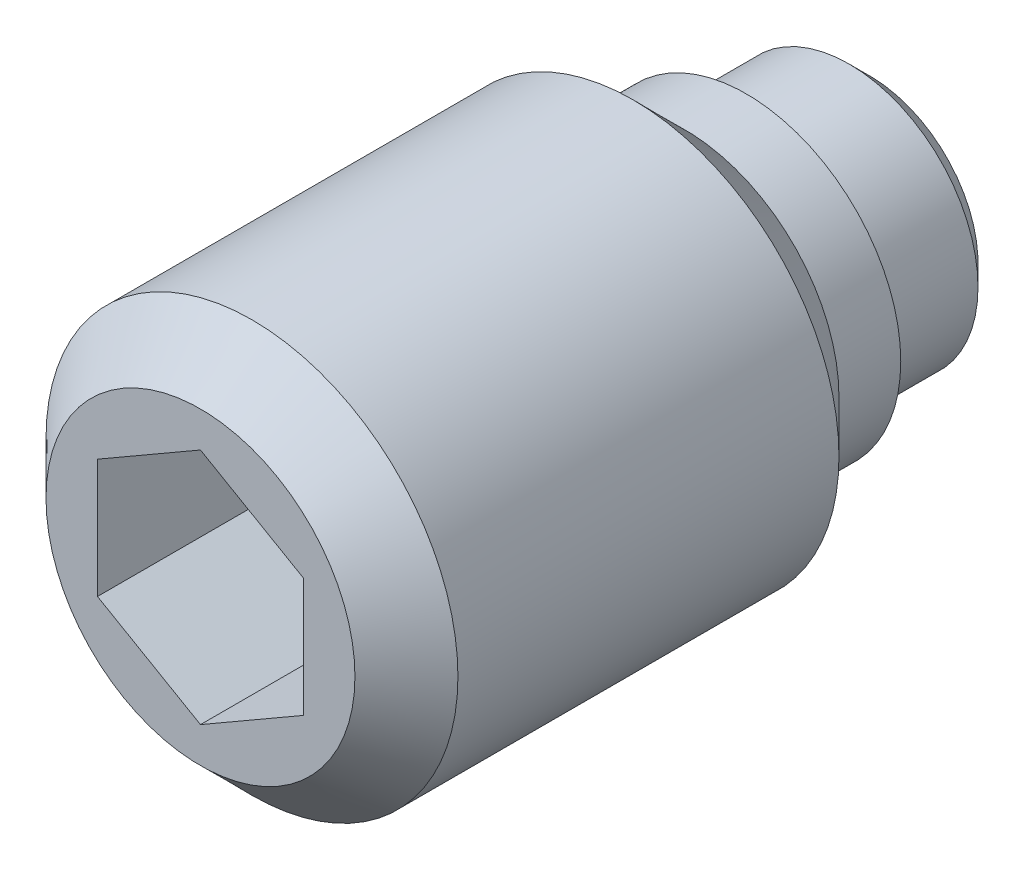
ISO-10303-21;
HEADER;
FILE_DESCRIPTION(('STEP AP214'),'2;1');
FILE_NAME('part.step','',(''),(''),'','','');
FILE_SCHEMA(('AUTOMOTIVE_DESIGN { 1 0 10303 214 1 1 1 1 }'));
ENDSEC;
DATA;
#1=APPLICATION_CONTEXT('core data for automotive mechanical design processes');
#2=APPLICATION_PROTOCOL_DEFINITION('international standard','automotive_design',2000,#1);
#3=PRODUCT_CONTEXT('',#1,'mechanical');
#4=PRODUCT('Part','Part','',(#3));
#5=PRODUCT_RELATED_PRODUCT_CATEGORY('part','',(#4));
#6=PRODUCT_DEFINITION_FORMATION('','',#4);
#7=PRODUCT_DEFINITION_CONTEXT('part definition',#1,'design');
#8=PRODUCT_DEFINITION('design','',#6,#7);
#9=PRODUCT_DEFINITION_SHAPE('','',#8);
#10=(LENGTH_UNIT() NAMED_UNIT(*) SI_UNIT(.MILLI.,.METRE.));
#11=(NAMED_UNIT(*) PLANE_ANGLE_UNIT() SI_UNIT($,.RADIAN.));
#12=(NAMED_UNIT(*) SI_UNIT($,.STERADIAN.) SOLID_ANGLE_UNIT());
#13=UNCERTAINTY_MEASURE_WITH_UNIT(LENGTH_MEASURE(1.E-05),#10,'distance_accuracy_value','');
#14=(GEOMETRIC_REPRESENTATION_CONTEXT(3) GLOBAL_UNCERTAINTY_ASSIGNED_CONTEXT((#13)) GLOBAL_UNIT_ASSIGNED_CONTEXT((#10,
#11,#12)) REPRESENTATION_CONTEXT('',''));
#15=CARTESIAN_POINT('',(0.,0.,0.));
#16=DIRECTION('',(0.,0.,1.));
#17=DIRECTION('',(1.,0.,0.));
#18=AXIS2_PLACEMENT_3D('',#15,#16,#17);
#19=CARTESIAN_POINT('',(0.,0.,1.2));
#20=DIRECTION('',(0.,0.,-1.));
#21=DIRECTION('',(-1.,0.,0.));
#22=AXIS2_PLACEMENT_3D('',#19,#20,#21);
#23=CYLINDRICAL_SURFACE('',#22,2.);
#24=CARTESIAN_POINT('',(0.,0.,2.3));
#25=DIRECTION('',(0.,0.,-1.));
#26=DIRECTION('',(-1.,0.,0.));
#27=AXIS2_PLACEMENT_3D('',#24,#25,#26);
#28=CIRCLE('',#27,2.);
#29=CARTESIAN_POINT('',(-2.,0.,2.3));
#30=VERTEX_POINT('',#29);
#31=EDGE_CURVE('E9',#30,#30,#28,.T.);
#32=ORIENTED_EDGE('',*,*,#31,.F.);
#33=EDGE_LOOP('',(#32));
#34=FACE_BOUND('',#33,.T.);
#35=CARTESIAN_POINT('',(0.,0.,6.));
#36=DIRECTION('',(0.,0.,1.));
#37=DIRECTION('',(1.,0.,0.));
#38=AXIS2_PLACEMENT_3D('',#35,#36,#37);
#39=CIRCLE('',#38,2.);
#40=CARTESIAN_POINT('',(2.,0.,6.));
#41=VERTEX_POINT('',#40);
#42=EDGE_CURVE('E115',#41,#41,#39,.T.);
#43=ORIENTED_EDGE('',*,*,#42,.F.);
#44=EDGE_LOOP('',(#43));
#45=FACE_BOUND('',#44,.T.);
#46=ADVANCED_FACE('F14',(#34,#45),#23,.T.);
#47=CARTESIAN_POINT('',(0.,0.,2.3));
#48=DIRECTION('',(0.,0.,1.));
#49=DIRECTION('',(1.,0.,0.));
#50=AXIS2_PLACEMENT_3D('',#47,#48,#49);
#51=CONICAL_SURFACE('',#50,2.,0.785398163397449);
#52=ORIENTED_EDGE('',*,*,#31,.T.);
#53=EDGE_LOOP('',(#52));
#54=FACE_BOUND('',#53,.T.);
#55=CARTESIAN_POINT('',(0.,0.,1.8));
#56=DIRECTION('',(0.,0.,-1.));
#57=DIRECTION('',(-1.,0.,0.));
#58=AXIS2_PLACEMENT_3D('',#55,#56,#57);
#59=CIRCLE('',#58,1.5);
#60=CARTESIAN_POINT('',(-1.5,0.,1.8));
#61=VERTEX_POINT('',#60);
#62=EDGE_CURVE('E21',#61,#61,#59,.T.);
#63=ORIENTED_EDGE('',*,*,#62,.F.);
#64=EDGE_LOOP('',(#63));
#65=FACE_BOUND('',#64,.T.);
#66=ADVANCED_FACE('F142',(#54,#65),#51,.T.);
#67=CARTESIAN_POINT('',(0.,0.,1.2));
#68=DIRECTION('',(0.,0.,-1.));
#69=DIRECTION('',(-1.,0.,0.));
#70=AXIS2_PLACEMENT_3D('',#67,#68,#69);
#71=CYLINDRICAL_SURFACE('',#70,1.5);
#72=CARTESIAN_POINT('',(0.,0.,1.2));
#73=DIRECTION('',(0.,0.,-1.));
#74=DIRECTION('',(-1.,0.,0.));
#75=AXIS2_PLACEMENT_3D('',#72,#73,#74);
#76=CIRCLE('',#75,1.5);
#77=CARTESIAN_POINT('',(-1.5,0.,1.2));
#78=VERTEX_POINT('',#77);
#79=EDGE_CURVE('E135',#78,#78,#76,.T.);
#80=ORIENTED_EDGE('',*,*,#79,.F.);
#81=EDGE_LOOP('',(#80));
#82=FACE_BOUND('',#81,.T.);
#83=ORIENTED_EDGE('',*,*,#62,.T.);
#84=EDGE_LOOP('',(#83));
#85=FACE_BOUND('',#84,.T.);
#86=ADVANCED_FACE('F140',(#82,#85),#71,.T.);
#87=CARTESIAN_POINT('',(0.,1.5,1.2));
#88=DIRECTION('',(0.,0.,1.));
#89=DIRECTION('',(1.,0.,0.));
#90=AXIS2_PLACEMENT_3D('',#87,#88,#89);
#91=PLANE('',#90);
#92=CARTESIAN_POINT('',(0.,0.,1.2));
#93=DIRECTION('',(0.,0.,-1.));
#94=DIRECTION('',(-1.,0.,0.));
#95=AXIS2_PLACEMENT_3D('',#92,#93,#94);
#96=CIRCLE('',#95,1.25);
#97=CARTESIAN_POINT('',(-1.25,0.,1.2));
#98=VERTEX_POINT('',#97);
#99=EDGE_CURVE('E132',#98,#98,#96,.T.);
#100=ORIENTED_EDGE('',*,*,#99,.F.);
#101=EDGE_LOOP('',(#100));
#102=FACE_BOUND('',#101,.T.);
#103=ORIENTED_EDGE('',*,*,#79,.T.);
#104=EDGE_LOOP('',(#103));
#105=FACE_BOUND('',#104,.T.);
#106=ADVANCED_FACE('F150',(#102,#105),#91,.F.);
#107=CARTESIAN_POINT('',(0.,0.,0.));
#108=DIRECTION('',(0.,0.,-1.));
#109=DIRECTION('',(-1.,0.,0.));
#110=AXIS2_PLACEMENT_3D('',#107,#108,#109);
#111=CYLINDRICAL_SURFACE('',#110,1.25);
#112=CARTESIAN_POINT('',(0.,0.,0.2));
#113=DIRECTION('',(0.,0.,-1.));
#114=DIRECTION('',(-1.,0.,0.));
#115=AXIS2_PLACEMENT_3D('',#112,#113,#114);
#116=CIRCLE('',#115,1.25);
#117=CARTESIAN_POINT('',(-1.25,0.,0.2));
#118=VERTEX_POINT('',#117);
#119=EDGE_CURVE('E129',#118,#118,#116,.T.);
#120=ORIENTED_EDGE('',*,*,#119,.F.);
#121=EDGE_LOOP('',(#120));
#122=FACE_BOUND('',#121,.T.);
#123=ORIENTED_EDGE('',*,*,#99,.T.);
#124=EDGE_LOOP('',(#123));
#125=FACE_BOUND('',#124,.T.);
#126=ADVANCED_FACE('F157',(#122,#125),#111,.T.);
#127=CARTESIAN_POINT('',(0.,0.,0.2));
#128=DIRECTION('',(0.,0.,1.));
#129=DIRECTION('',(1.,0.,0.));
#130=AXIS2_PLACEMENT_3D('',#127,#128,#129);
#131=CONICAL_SURFACE('',#130,1.25,0.785398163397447);
#132=CARTESIAN_POINT('',(0.,0.,0.));
#133=DIRECTION('',(0.,0.,-1.));
#134=DIRECTION('',(-1.,0.,0.));
#135=AXIS2_PLACEMENT_3D('',#132,#133,#134);
#136=CIRCLE('',#135,1.05);
#137=CARTESIAN_POINT('',(-1.05,0.,0.));
#138=VERTEX_POINT('',#137);
#139=EDGE_CURVE('E126',#138,#138,#136,.T.);
#140=ORIENTED_EDGE('',*,*,#139,.F.);
#141=EDGE_LOOP('',(#140));
#142=FACE_BOUND('',#141,.T.);
#143=ORIENTED_EDGE('',*,*,#119,.T.);
#144=EDGE_LOOP('',(#143));
#145=FACE_BOUND('',#144,.T.);
#146=ADVANCED_FACE('F161',(#142,#145),#131,.T.);
#147=CARTESIAN_POINT('',(0.,1.05,0.));
#148=DIRECTION('',(0.,0.,1.));
#149=DIRECTION('',(1.,0.,0.));
#150=AXIS2_PLACEMENT_3D('',#147,#148,#149);
#151=PLANE('',#150);
#152=ORIENTED_EDGE('',*,*,#139,.T.);
#153=EDGE_LOOP('',(#152));
#154=FACE_BOUND('',#153,.T.);
#155=ADVANCED_FACE('F165',(#154),#151,.F.);
#156=CARTESIAN_POINT('',(0.,0.,6.5));
#157=DIRECTION('',(0.,0.,1.));
#158=DIRECTION('',(1.,0.,0.));
#159=AXIS2_PLACEMENT_3D('',#156,#157,#158);
#160=PLANE('',#159);
#161=DIRECTION('',(0.866025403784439,-0.5,0.));
#162=VECTOR('',#161,1.);
#163=CARTESIAN_POINT('',(-1.,-0.577350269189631,6.5));
#164=LINE('',#163,#162);
#165=CARTESIAN_POINT('',(-1.,-0.577350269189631,6.5));
#166=VERTEX_POINT('',#165);
#167=CARTESIAN_POINT('',(0.,-1.15470053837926,6.5));
#168=VERTEX_POINT('',#167);
#169=EDGE_CURVE('E28',#166,#168,#164,.T.);
#170=ORIENTED_EDGE('',*,*,#169,.F.);
#171=DIRECTION('',(0.,-1.,0.));
#172=VECTOR('',#171,1.);
#173=CARTESIAN_POINT('',(-1.,0.577350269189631,6.5));
#174=LINE('',#173,#172);
#175=CARTESIAN_POINT('',(-1.,0.577350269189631,6.5));
#176=VERTEX_POINT('',#175);
#177=EDGE_CURVE('E111',#176,#166,#174,.T.);
#178=ORIENTED_EDGE('',*,*,#177,.F.);
#179=DIRECTION('',(-0.866025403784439,-0.5,0.));
#180=VECTOR('',#179,1.);
#181=CARTESIAN_POINT('',(0.,1.15470053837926,6.5));
#182=LINE('',#181,#180);
#183=CARTESIAN_POINT('',(0.,1.15470053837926,6.5));
#184=VERTEX_POINT('',#183);
#185=EDGE_CURVE('E109',#184,#176,#182,.T.);
#186=ORIENTED_EDGE('',*,*,#185,.F.);
#187=DIRECTION('',(-0.866025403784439,0.5,0.));
#188=VECTOR('',#187,1.);
#189=CARTESIAN_POINT('',(1.,0.577350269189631,6.5));
#190=LINE('',#189,#188);
#191=CARTESIAN_POINT('',(1.,0.577350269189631,6.5));
#192=VERTEX_POINT('',#191);
#193=EDGE_CURVE('E76',#192,#184,#190,.T.);
#194=ORIENTED_EDGE('',*,*,#193,.F.);
#195=DIRECTION('',(0.,1.,0.));
#196=VECTOR('',#195,1.);
#197=CARTESIAN_POINT('',(1.,-0.577350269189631,6.5));
#198=LINE('',#197,#196);
#199=CARTESIAN_POINT('',(1.,-0.577350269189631,6.5));
#200=VERTEX_POINT('',#199);
#201=EDGE_CURVE('E105',#200,#192,#198,.T.);
#202=ORIENTED_EDGE('',*,*,#201,.F.);
#203=DIRECTION('',(0.866025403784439,0.5,0.));
#204=VECTOR('',#203,1.);
#205=CARTESIAN_POINT('',(0.,-1.15470053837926,6.5));
#206=LINE('',#205,#204);
#207=EDGE_CURVE('E102',#168,#200,#206,.T.);
#208=ORIENTED_EDGE('',*,*,#207,.F.);
#209=EDGE_LOOP('',(#170,#178,#186,#194,#202,#208));
#210=FACE_BOUND('',#209,.T.);
#211=CARTESIAN_POINT('',(0.,0.,6.5));
#212=DIRECTION('',(0.,0.,1.));
#213=DIRECTION('',(1.,0.,0.));
#214=AXIS2_PLACEMENT_3D('',#211,#212,#213);
#215=CIRCLE('',#214,1.5);
#216=CARTESIAN_POINT('',(1.5,0.,6.5));
#217=VERTEX_POINT('',#216);
#218=EDGE_CURVE('E123',#217,#217,#215,.T.);
#219=ORIENTED_EDGE('',*,*,#218,.T.);
#220=EDGE_LOOP('',(#219));
#221=FACE_BOUND('',#220,.T.);
#222=ADVANCED_FACE('F169',(#210,#221),#160,.T.);
#223=CARTESIAN_POINT('',(0.,0.,6.5));
#224=DIRECTION('',(0.,0.,-1.));
#225=DIRECTION('',(-1.,0.,0.));
#226=AXIS2_PLACEMENT_3D('',#223,#224,#225);
#227=CONICAL_SURFACE('',#226,1.5,0.785398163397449);
#228=ORIENTED_EDGE('',*,*,#42,.T.);
#229=EDGE_LOOP('',(#228));
#230=FACE_BOUND('',#229,.T.);
#231=ORIENTED_EDGE('',*,*,#218,.F.);
#232=EDGE_LOOP('',(#231));
#233=FACE_BOUND('',#232,.T.);
#234=ADVANCED_FACE('F173',(#230,#233),#227,.T.);
#235=CARTESIAN_POINT('',(-1.,-0.577350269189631,4.5));
#236=DIRECTION('',(-0.5,-0.866025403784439,0.));
#237=DIRECTION('',(0.866025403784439,-0.5,0.));
#238=AXIS2_PLACEMENT_3D('',#235,#236,#237);
#239=PLANE('',#238);
#240=ORIENTED_EDGE('',*,*,#169,.T.);
#241=DIRECTION('',(0.,0.,1.));
#242=VECTOR('',#241,1.);
#243=CARTESIAN_POINT('',(0.,-1.15470053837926,4.5));
#244=LINE('',#243,#242);
#245=CARTESIAN_POINT('',(0.,-1.15470053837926,4.5));
#246=VERTEX_POINT('',#245);
#247=EDGE_CURVE('E58',#246,#168,#244,.T.);
#248=ORIENTED_EDGE('',*,*,#247,.F.);
#249=DIRECTION('',(0.866025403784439,-0.5,0.));
#250=VECTOR('',#249,1.);
#251=CARTESIAN_POINT('',(-1.,-0.577350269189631,4.5));
#252=LINE('',#251,#250);
#253=CARTESIAN_POINT('',(-1.,-0.577350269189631,4.5));
#254=VERTEX_POINT('',#253);
#255=EDGE_CURVE('E113',#254,#246,#252,.T.);
#256=ORIENTED_EDGE('',*,*,#255,.F.);
#257=DIRECTION('',(0.,0.,1.));
#258=VECTOR('',#257,1.);
#259=CARTESIAN_POINT('',(-1.,-0.577350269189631,4.5));
#260=LINE('',#259,#258);
#261=EDGE_CURVE('E36',#254,#166,#260,.T.);
#262=ORIENTED_EDGE('',*,*,#261,.T.);
#263=EDGE_LOOP('',(#240,#248,#256,#262));
#264=FACE_BOUND('',#263,.T.);
#265=ADVANCED_FACE('F177',(#264),#239,.F.);
#266=CARTESIAN_POINT('',(-1.,0.577350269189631,4.5));
#267=DIRECTION('',(-1.,0.,0.));
#268=DIRECTION('',(0.,0.,1.));
#269=AXIS2_PLACEMENT_3D('',#266,#267,#268);
#270=PLANE('',#269);
#271=ORIENTED_EDGE('',*,*,#177,.T.);
#272=ORIENTED_EDGE('',*,*,#261,.F.);
#273=DIRECTION('',(0.,-1.,0.));
#274=VECTOR('',#273,1.);
#275=CARTESIAN_POINT('',(-1.,0.577350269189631,4.5));
#276=LINE('',#275,#274);
#277=CARTESIAN_POINT('',(-1.,0.577350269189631,4.5));
#278=VERTEX_POINT('',#277);
#279=EDGE_CURVE('E88',#278,#254,#276,.T.);
#280=ORIENTED_EDGE('',*,*,#279,.F.);
#281=DIRECTION('',(0.,0.,1.));
#282=VECTOR('',#281,1.);
#283=CARTESIAN_POINT('',(-1.,0.577350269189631,4.5));
#284=LINE('',#283,#282);
#285=EDGE_CURVE('E80',#278,#176,#284,.T.);
#286=ORIENTED_EDGE('',*,*,#285,.T.);
#287=EDGE_LOOP('',(#271,#272,#280,#286));
#288=FACE_BOUND('',#287,.T.);
#289=ADVANCED_FACE('F181',(#288),#270,.F.);
#290=CARTESIAN_POINT('',(0.,1.15470053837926,4.5));
#291=DIRECTION('',(-0.5,0.866025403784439,0.));
#292=DIRECTION('',(-0.866025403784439,-0.5,0.));
#293=AXIS2_PLACEMENT_3D('',#290,#291,#292);
#294=PLANE('',#293);
#295=ORIENTED_EDGE('',*,*,#185,.T.);
#296=ORIENTED_EDGE('',*,*,#285,.F.);
#297=DIRECTION('',(-0.866025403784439,-0.5,0.));
#298=VECTOR('',#297,1.);
#299=CARTESIAN_POINT('',(0.,1.15470053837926,4.5));
#300=LINE('',#299,#298);
#301=CARTESIAN_POINT('',(0.,1.15470053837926,4.5));
#302=VERTEX_POINT('',#301);
#303=EDGE_CURVE('E84',#302,#278,#300,.T.);
#304=ORIENTED_EDGE('',*,*,#303,.F.);
#305=DIRECTION('',(0.,0.,1.));
#306=VECTOR('',#305,1.);
#307=CARTESIAN_POINT('',(0.,1.15470053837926,4.5));
#308=LINE('',#307,#306);
#309=EDGE_CURVE('E69',#302,#184,#308,.T.);
#310=ORIENTED_EDGE('',*,*,#309,.T.);
#311=EDGE_LOOP('',(#295,#296,#304,#310));
#312=FACE_BOUND('',#311,.T.);
#313=ADVANCED_FACE('F85',(#312),#294,.F.);
#314=CARTESIAN_POINT('',(1.,0.577350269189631,4.5));
#315=DIRECTION('',(0.5,0.866025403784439,0.));
#316=DIRECTION('',(-0.866025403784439,0.5,0.));
#317=AXIS2_PLACEMENT_3D('',#314,#315,#316);
#318=PLANE('',#317);
#319=ORIENTED_EDGE('',*,*,#193,.T.);
#320=ORIENTED_EDGE('',*,*,#309,.F.);
#321=DIRECTION('',(-0.866025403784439,0.5,0.));
#322=VECTOR('',#321,1.);
#323=CARTESIAN_POINT('',(1.,0.577350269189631,4.5));
#324=LINE('',#323,#322);
#325=CARTESIAN_POINT('',(1.,0.577350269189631,4.5));
#326=VERTEX_POINT('',#325);
#327=EDGE_CURVE('E73',#326,#302,#324,.T.);
#328=ORIENTED_EDGE('',*,*,#327,.F.);
#329=DIRECTION('',(0.,0.,1.));
#330=VECTOR('',#329,1.);
#331=CARTESIAN_POINT('',(1.,0.577350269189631,4.5));
#332=LINE('',#331,#330);
#333=EDGE_CURVE('E81',#326,#192,#332,.T.);
#334=ORIENTED_EDGE('',*,*,#333,.T.);
#335=EDGE_LOOP('',(#319,#320,#328,#334));
#336=FACE_BOUND('',#335,.T.);
#337=ADVANCED_FACE('F71',(#336),#318,.F.);
#338=CARTESIAN_POINT('',(1.,-0.577350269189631,4.5));
#339=DIRECTION('',(1.,0.,0.));
#340=DIRECTION('',(0.,0.,-1.));
#341=AXIS2_PLACEMENT_3D('',#338,#339,#340);
#342=PLANE('',#341);
#343=ORIENTED_EDGE('',*,*,#201,.T.);
#344=ORIENTED_EDGE('',*,*,#333,.F.);
#345=DIRECTION('',(0.,1.,0.));
#346=VECTOR('',#345,1.);
#347=CARTESIAN_POINT('',(1.,-0.577350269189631,4.5));
#348=LINE('',#347,#346);
#349=CARTESIAN_POINT('',(1.,-0.577350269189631,4.5));
#350=VERTEX_POINT('',#349);
#351=EDGE_CURVE('E94',#350,#326,#348,.T.);
#352=ORIENTED_EDGE('',*,*,#351,.F.);
#353=DIRECTION('',(0.,0.,1.));
#354=VECTOR('',#353,1.);
#355=CARTESIAN_POINT('',(1.,-0.577350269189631,4.5));
#356=LINE('',#355,#354);
#357=EDGE_CURVE('E118',#350,#200,#356,.T.);
#358=ORIENTED_EDGE('',*,*,#357,.T.);
#359=EDGE_LOOP('',(#343,#344,#352,#358));
#360=FACE_BOUND('',#359,.T.);
#361=ADVANCED_FACE('F185',(#360),#342,.F.);
#362=CARTESIAN_POINT('',(0.,-1.15470053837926,4.5));
#363=DIRECTION('',(0.5,-0.866025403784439,0.));
#364=DIRECTION('',(0.866025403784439,0.5,0.));
#365=AXIS2_PLACEMENT_3D('',#362,#363,#364);
#366=PLANE('',#365);
#367=ORIENTED_EDGE('',*,*,#207,.T.);
#368=ORIENTED_EDGE('',*,*,#357,.F.);
#369=DIRECTION('',(0.866025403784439,0.5,0.));
#370=VECTOR('',#369,1.);
#371=CARTESIAN_POINT('',(0.,-1.15470053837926,4.5));
#372=LINE('',#371,#370);
#373=EDGE_CURVE('E96',#246,#350,#372,.T.);
#374=ORIENTED_EDGE('',*,*,#373,.F.);
#375=ORIENTED_EDGE('',*,*,#247,.T.);
#376=EDGE_LOOP('',(#367,#368,#374,#375));
#377=FACE_BOUND('',#376,.T.);
#378=ADVANCED_FACE('F182',(#377),#366,.F.);
#379=CARTESIAN_POINT('',(0.,0.,4.5));
#380=DIRECTION('',(0.,0.,1.));
#381=DIRECTION('',(1.,0.,0.));
#382=AXIS2_PLACEMENT_3D('',#379,#380,#381);
#383=PLANE('',#382);
#384=ORIENTED_EDGE('',*,*,#255,.T.);
#385=ORIENTED_EDGE('',*,*,#373,.T.);
#386=ORIENTED_EDGE('',*,*,#351,.T.);
#387=ORIENTED_EDGE('',*,*,#327,.T.);
#388=ORIENTED_EDGE('',*,*,#303,.T.);
#389=ORIENTED_EDGE('',*,*,#279,.T.);
#390=EDGE_LOOP('',(#384,#385,#386,#387,#388,#389));
#391=FACE_BOUND('',#390,.T.);
#392=ADVANCED_FACE('F91',(#391),#383,.T.);
#393=CLOSED_SHELL('',(#46,#66,#86,#106,#126,#146,#155,#222,#234,#265,#289,#313,#337,#361,#378,#392));
#394=MANIFOLD_SOLID_BREP('B1',#393);
#395=ADVANCED_BREP_SHAPE_REPRESENTATION('',(#18,#394),#14);
#396=SHAPE_DEFINITION_REPRESENTATION(#9,#395);
ENDSEC;
END-ISO-10303-21;
